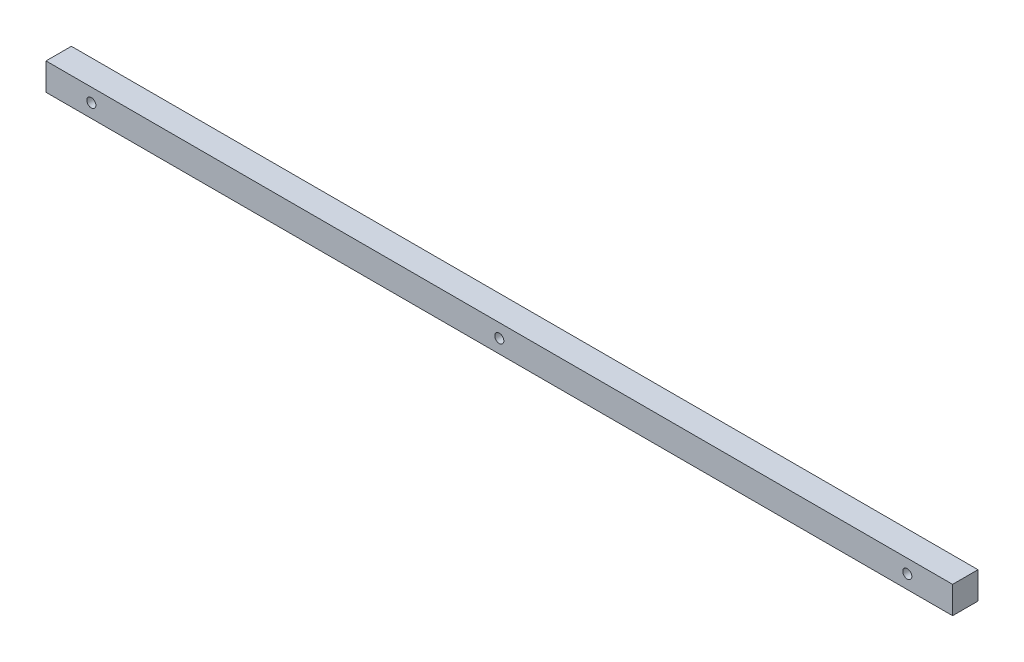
ISO-10303-21;
HEADER;
FILE_DESCRIPTION(('STEP AP214'),'2;1');
FILE_NAME('part.step','',(''),(''),'','','');
FILE_SCHEMA(('AUTOMOTIVE_DESIGN { 1 0 10303 214 1 1 1 1 }'));
ENDSEC;
DATA;
#1=APPLICATION_CONTEXT('core data for automotive mechanical design processes');
#2=APPLICATION_PROTOCOL_DEFINITION('international standard','automotive_design',2000,#1);
#3=PRODUCT_CONTEXT('',#1,'mechanical');
#4=PRODUCT('Part','Part','',(#3));
#5=PRODUCT_RELATED_PRODUCT_CATEGORY('part','',(#4));
#6=PRODUCT_DEFINITION_FORMATION('','',#4);
#7=PRODUCT_DEFINITION_CONTEXT('part definition',#1,'design');
#8=PRODUCT_DEFINITION('design','',#6,#7);
#9=PRODUCT_DEFINITION_SHAPE('','',#8);
#10=(LENGTH_UNIT() NAMED_UNIT(*) SI_UNIT(.MILLI.,.METRE.));
#11=(NAMED_UNIT(*) PLANE_ANGLE_UNIT() SI_UNIT($,.RADIAN.));
#12=(NAMED_UNIT(*) SI_UNIT($,.STERADIAN.) SOLID_ANGLE_UNIT());
#13=UNCERTAINTY_MEASURE_WITH_UNIT(LENGTH_MEASURE(1.E-05),#10,'distance_accuracy_value','');
#14=(GEOMETRIC_REPRESENTATION_CONTEXT(3) GLOBAL_UNCERTAINTY_ASSIGNED_CONTEXT((#13)) GLOBAL_UNIT_ASSIGNED_CONTEXT((#10,
#11,#12)) REPRESENTATION_CONTEXT('',''));
#15=CARTESIAN_POINT('',(0.,0.,0.));
#16=DIRECTION('',(0.,0.,1.));
#17=DIRECTION('',(1.,0.,0.));
#18=AXIS2_PLACEMENT_3D('',#15,#16,#17);
#19=CARTESIAN_POINT('',(0.,0.,28.));
#20=DIRECTION('',(0.,0.,1.));
#21=DIRECTION('',(1.,0.,0.));
#22=AXIS2_PLACEMENT_3D('',#19,#20,#21);
#23=PLANE('',#22);
#24=CARTESIAN_POINT('',(-450.,0.,28.));
#25=DIRECTION('',(0.,0.,1.));
#26=DIRECTION('',(1.,0.,0.));
#27=AXIS2_PLACEMENT_3D('',#24,#25,#26);
#28=CIRCLE('',#27,4.99999999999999);
#29=CARTESIAN_POINT('',(-445.,0.,28.));
#30=VERTEX_POINT('',#29);
#31=EDGE_CURVE('E130',#30,#30,#28,.T.);
#32=ORIENTED_EDGE('',*,*,#31,.F.);
#33=EDGE_LOOP('',(#32));
#34=FACE_BOUND('',#33,.T.);
#35=DIRECTION('',(0.,-1.,0.));
#36=VECTOR('',#35,1.);
#37=CARTESIAN_POINT('',(-500.,15.,28.));
#38=LINE('',#37,#36);
#39=CARTESIAN_POINT('',(-500.,15.,28.));
#40=VERTEX_POINT('',#39);
#41=CARTESIAN_POINT('',(-500.,-15.,28.));
#42=VERTEX_POINT('',#41);
#43=EDGE_CURVE('E91',#40,#42,#38,.T.);
#44=ORIENTED_EDGE('',*,*,#43,.T.);
#45=DIRECTION('',(1.,0.,0.));
#46=VECTOR('',#45,1.);
#47=CARTESIAN_POINT('',(-500.,-15.,28.));
#48=LINE('',#47,#46);
#49=CARTESIAN_POINT('',(500.,-15.,28.));
#50=VERTEX_POINT('',#49);
#51=EDGE_CURVE('E86',#42,#50,#48,.T.);
#52=ORIENTED_EDGE('',*,*,#51,.T.);
#53=DIRECTION('',(0.,1.,0.));
#54=VECTOR('',#53,1.);
#55=CARTESIAN_POINT('',(500.,15.,28.));
#56=LINE('',#55,#54);
#57=CARTESIAN_POINT('',(500.,15.,28.));
#58=VERTEX_POINT('',#57);
#59=EDGE_CURVE('E89',#50,#58,#56,.T.);
#60=ORIENTED_EDGE('',*,*,#59,.T.);
#61=DIRECTION('',(-1.,0.,0.));
#62=VECTOR('',#61,1.);
#63=CARTESIAN_POINT('',(-500.,15.,28.));
#64=LINE('',#63,#62);
#65=EDGE_CURVE('E56',#58,#40,#64,.T.);
#66=ORIENTED_EDGE('',*,*,#65,.T.);
#67=EDGE_LOOP('',(#44,#52,#60,#66));
#68=FACE_BOUND('',#67,.T.);
#69=CARTESIAN_POINT('',(450.,0.,28.));
#70=DIRECTION('',(0.,0.,1.));
#71=DIRECTION('',(1.,0.,0.));
#72=AXIS2_PLACEMENT_3D('',#69,#70,#71);
#73=CIRCLE('',#72,4.99999999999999);
#74=CARTESIAN_POINT('',(455.,0.,28.));
#75=VERTEX_POINT('',#74);
#76=EDGE_CURVE('E109',#75,#75,#73,.T.);
#77=ORIENTED_EDGE('',*,*,#76,.F.);
#78=EDGE_LOOP('',(#77));
#79=FACE_BOUND('',#78,.T.);
#80=CARTESIAN_POINT('',(-1.11022302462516E-13,0.,28.));
#81=DIRECTION('',(0.,0.,1.));
#82=DIRECTION('',(1.,0.,0.));
#83=AXIS2_PLACEMENT_3D('',#80,#81,#82);
#84=CIRCLE('',#83,5.);
#85=CARTESIAN_POINT('',(4.99999999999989,0.,28.));
#86=VERTEX_POINT('',#85);
#87=EDGE_CURVE('E138',#86,#86,#84,.T.);
#88=ORIENTED_EDGE('',*,*,#87,.F.);
#89=EDGE_LOOP('',(#88));
#90=FACE_BOUND('',#89,.T.);
#91=ADVANCED_FACE('F38',(#34,#68,#79,#90),#23,.T.);
#92=CARTESIAN_POINT('',(0.,0.,0.));
#93=DIRECTION('',(0.,0.,1.));
#94=DIRECTION('',(1.,0.,0.));
#95=AXIS2_PLACEMENT_3D('',#92,#93,#94);
#96=PLANE('',#95);
#97=DIRECTION('',(0.,-1.,0.));
#98=VECTOR('',#97,1.);
#99=CARTESIAN_POINT('',(-500.,15.,0.));
#100=LINE('',#99,#98);
#101=CARTESIAN_POINT('',(-500.,15.,0.));
#102=VERTEX_POINT('',#101);
#103=CARTESIAN_POINT('',(-500.,-15.,0.));
#104=VERTEX_POINT('',#103);
#105=EDGE_CURVE('E106',#102,#104,#100,.T.);
#106=ORIENTED_EDGE('',*,*,#105,.F.);
#107=DIRECTION('',(-1.,0.,0.));
#108=VECTOR('',#107,1.);
#109=CARTESIAN_POINT('',(-500.,15.,0.));
#110=LINE('',#109,#108);
#111=CARTESIAN_POINT('',(500.,15.,0.));
#112=VERTEX_POINT('',#111);
#113=EDGE_CURVE('E79',#112,#102,#110,.T.);
#114=ORIENTED_EDGE('',*,*,#113,.F.);
#115=DIRECTION('',(0.,1.,0.));
#116=VECTOR('',#115,1.);
#117=CARTESIAN_POINT('',(500.,15.,0.));
#118=LINE('',#117,#116);
#119=CARTESIAN_POINT('',(500.,-15.,0.));
#120=VERTEX_POINT('',#119);
#121=EDGE_CURVE('E73',#120,#112,#118,.T.);
#122=ORIENTED_EDGE('',*,*,#121,.F.);
#123=DIRECTION('',(1.,0.,0.));
#124=VECTOR('',#123,1.);
#125=CARTESIAN_POINT('',(-500.,-15.,0.));
#126=LINE('',#125,#124);
#127=EDGE_CURVE('E96',#104,#120,#126,.T.);
#128=ORIENTED_EDGE('',*,*,#127,.F.);
#129=EDGE_LOOP('',(#106,#114,#122,#128));
#130=FACE_BOUND('',#129,.T.);
#131=CARTESIAN_POINT('',(450.,0.,0.));
#132=DIRECTION('',(0.,0.,1.));
#133=DIRECTION('',(1.,0.,0.));
#134=AXIS2_PLACEMENT_3D('',#131,#132,#133);
#135=CIRCLE('',#134,4.99999999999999);
#136=CARTESIAN_POINT('',(455.,0.,0.));
#137=VERTEX_POINT('',#136);
#138=EDGE_CURVE('E127',#137,#137,#135,.T.);
#139=ORIENTED_EDGE('',*,*,#138,.T.);
#140=EDGE_LOOP('',(#139));
#141=FACE_BOUND('',#140,.T.);
#142=CARTESIAN_POINT('',(-450.,0.,0.));
#143=DIRECTION('',(0.,0.,1.));
#144=DIRECTION('',(1.,0.,0.));
#145=AXIS2_PLACEMENT_3D('',#142,#143,#144);
#146=CIRCLE('',#145,4.99999999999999);
#147=CARTESIAN_POINT('',(-445.,0.,0.));
#148=VERTEX_POINT('',#147);
#149=EDGE_CURVE('E134',#148,#148,#146,.T.);
#150=ORIENTED_EDGE('',*,*,#149,.T.);
#151=EDGE_LOOP('',(#150));
#152=FACE_BOUND('',#151,.T.);
#153=CARTESIAN_POINT('',(-1.11022302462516E-13,0.,0.));
#154=DIRECTION('',(0.,0.,1.));
#155=DIRECTION('',(1.,0.,0.));
#156=AXIS2_PLACEMENT_3D('',#153,#154,#155);
#157=CIRCLE('',#156,5.);
#158=CARTESIAN_POINT('',(4.99999999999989,0.,0.));
#159=VERTEX_POINT('',#158);
#160=EDGE_CURVE('E142',#159,#159,#157,.T.);
#161=ORIENTED_EDGE('',*,*,#160,.T.);
#162=EDGE_LOOP('',(#161));
#163=FACE_BOUND('',#162,.T.);
#164=ADVANCED_FACE('F119',(#130,#141,#152,#163),#96,.F.);
#165=CARTESIAN_POINT('',(-500.,15.,28.));
#166=DIRECTION('',(1.,0.,0.));
#167=DIRECTION('',(0.,0.,-1.));
#168=AXIS2_PLACEMENT_3D('',#165,#166,#167);
#169=PLANE('',#168);
#170=ORIENTED_EDGE('',*,*,#105,.T.);
#171=DIRECTION('',(0.,0.,-1.));
#172=VECTOR('',#171,1.);
#173=CARTESIAN_POINT('',(-500.,-15.,28.));
#174=LINE('',#173,#172);
#175=EDGE_CURVE('E11',#42,#104,#174,.T.);
#176=ORIENTED_EDGE('',*,*,#175,.F.);
#177=ORIENTED_EDGE('',*,*,#43,.F.);
#178=DIRECTION('',(0.,0.,-1.));
#179=VECTOR('',#178,1.);
#180=CARTESIAN_POINT('',(-500.,15.,28.));
#181=LINE('',#180,#179);
#182=EDGE_CURVE('E102',#40,#102,#181,.T.);
#183=ORIENTED_EDGE('',*,*,#182,.T.);
#184=EDGE_LOOP('',(#170,#176,#177,#183));
#185=FACE_BOUND('',#184,.T.);
#186=ADVANCED_FACE('F40',(#185),#169,.F.);
#187=CARTESIAN_POINT('',(-500.,-15.,28.));
#188=DIRECTION('',(0.,1.,0.));
#189=DIRECTION('',(0.,0.,1.));
#190=AXIS2_PLACEMENT_3D('',#187,#188,#189);
#191=PLANE('',#190);
#192=ORIENTED_EDGE('',*,*,#127,.T.);
#193=DIRECTION('',(0.,0.,-1.));
#194=VECTOR('',#193,1.);
#195=CARTESIAN_POINT('',(500.,-15.,28.));
#196=LINE('',#195,#194);
#197=EDGE_CURVE('E48',#50,#120,#196,.T.);
#198=ORIENTED_EDGE('',*,*,#197,.F.);
#199=ORIENTED_EDGE('',*,*,#51,.F.);
#200=ORIENTED_EDGE('',*,*,#175,.T.);
#201=EDGE_LOOP('',(#192,#198,#199,#200));
#202=FACE_BOUND('',#201,.T.);
#203=ADVANCED_FACE('F95',(#202),#191,.F.);
#204=CARTESIAN_POINT('',(500.,15.,28.));
#205=DIRECTION('',(-1.,0.,0.));
#206=DIRECTION('',(0.,0.,1.));
#207=AXIS2_PLACEMENT_3D('',#204,#205,#206);
#208=PLANE('',#207);
#209=ORIENTED_EDGE('',*,*,#121,.T.);
#210=DIRECTION('',(0.,0.,-1.));
#211=VECTOR('',#210,1.);
#212=CARTESIAN_POINT('',(500.,15.,28.));
#213=LINE('',#212,#211);
#214=EDGE_CURVE('E98',#58,#112,#213,.T.);
#215=ORIENTED_EDGE('',*,*,#214,.F.);
#216=ORIENTED_EDGE('',*,*,#59,.F.);
#217=ORIENTED_EDGE('',*,*,#197,.T.);
#218=EDGE_LOOP('',(#209,#215,#216,#217));
#219=FACE_BOUND('',#218,.T.);
#220=ADVANCED_FACE('F99',(#219),#208,.F.);
#221=CARTESIAN_POINT('',(-500.,15.,28.));
#222=DIRECTION('',(0.,-1.,0.));
#223=DIRECTION('',(0.,0.,-1.));
#224=AXIS2_PLACEMENT_3D('',#221,#222,#223);
#225=PLANE('',#224);
#226=ORIENTED_EDGE('',*,*,#113,.T.);
#227=ORIENTED_EDGE('',*,*,#182,.F.);
#228=ORIENTED_EDGE('',*,*,#65,.F.);
#229=ORIENTED_EDGE('',*,*,#214,.T.);
#230=EDGE_LOOP('',(#226,#227,#228,#229));
#231=FACE_BOUND('',#230,.T.);
#232=ADVANCED_FACE('F116',(#231),#225,.F.);
#233=CARTESIAN_POINT('',(450.,0.,28.));
#234=DIRECTION('',(0.,0.,-1.));
#235=DIRECTION('',(-1.,0.,0.));
#236=AXIS2_PLACEMENT_3D('',#233,#234,#235);
#237=CYLINDRICAL_SURFACE('',#236,4.99999999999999);
#238=ORIENTED_EDGE('',*,*,#76,.T.);
#239=EDGE_LOOP('',(#238));
#240=FACE_BOUND('',#239,.T.);
#241=ORIENTED_EDGE('',*,*,#138,.F.);
#242=EDGE_LOOP('',(#241));
#243=FACE_BOUND('',#242,.T.);
#244=ADVANCED_FACE('F162',(#240,#243),#237,.F.);
#245=CARTESIAN_POINT('',(-450.,0.,28.));
#246=DIRECTION('',(0.,0.,-1.));
#247=DIRECTION('',(-1.,0.,0.));
#248=AXIS2_PLACEMENT_3D('',#245,#246,#247);
#249=CYLINDRICAL_SURFACE('',#248,4.99999999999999);
#250=ORIENTED_EDGE('',*,*,#31,.T.);
#251=EDGE_LOOP('',(#250));
#252=FACE_BOUND('',#251,.T.);
#253=ORIENTED_EDGE('',*,*,#149,.F.);
#254=EDGE_LOOP('',(#253));
#255=FACE_BOUND('',#254,.T.);
#256=ADVANCED_FACE('F201',(#252,#255),#249,.F.);
#257=CARTESIAN_POINT('',(-1.11022302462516E-13,0.,28.));
#258=DIRECTION('',(0.,0.,-1.));
#259=DIRECTION('',(-1.,0.,0.));
#260=AXIS2_PLACEMENT_3D('',#257,#258,#259);
#261=CYLINDRICAL_SURFACE('',#260,5.);
#262=ORIENTED_EDGE('',*,*,#87,.T.);
#263=EDGE_LOOP('',(#262));
#264=FACE_BOUND('',#263,.T.);
#265=ORIENTED_EDGE('',*,*,#160,.F.);
#266=EDGE_LOOP('',(#265));
#267=FACE_BOUND('',#266,.T.);
#268=ADVANCED_FACE('F150',(#264,#267),#261,.F.);
#269=CLOSED_SHELL('',(#91,#164,#186,#203,#220,#232,#244,#256,#268));
#270=MANIFOLD_SOLID_BREP('B2',#269);
#271=ADVANCED_BREP_SHAPE_REPRESENTATION('',(#18,#270),#14);
#272=SHAPE_DEFINITION_REPRESENTATION(#9,#271);
ENDSEC;
END-ISO-10303-21;
